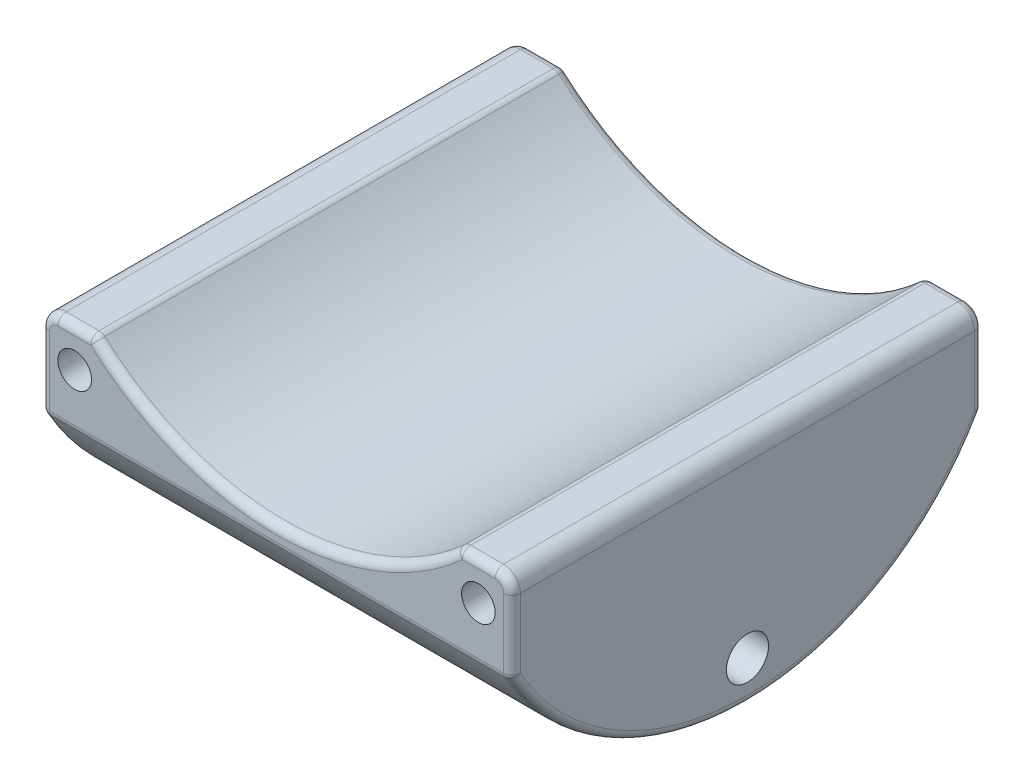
ISO-10303-21;
HEADER;
FILE_DESCRIPTION(('STEP AP214'),'2;1');
FILE_NAME('part.step','',(''),(''),'','','');
FILE_SCHEMA(('AUTOMOTIVE_DESIGN { 1 0 10303 214 1 1 1 1 }'));
ENDSEC;
DATA;
#1=APPLICATION_CONTEXT('core data for automotive mechanical design processes');
#2=APPLICATION_PROTOCOL_DEFINITION('international standard','automotive_design',2000,#1);
#3=PRODUCT_CONTEXT('',#1,'mechanical');
#4=PRODUCT('Part','Part','',(#3));
#5=PRODUCT_RELATED_PRODUCT_CATEGORY('part','',(#4));
#6=PRODUCT_DEFINITION_FORMATION('','',#4);
#7=PRODUCT_DEFINITION_CONTEXT('part definition',#1,'design');
#8=PRODUCT_DEFINITION('design','',#6,#7);
#9=PRODUCT_DEFINITION_SHAPE('','',#8);
#10=(LENGTH_UNIT() NAMED_UNIT(*) SI_UNIT(.MILLI.,.METRE.));
#11=(NAMED_UNIT(*) PLANE_ANGLE_UNIT() SI_UNIT($,.RADIAN.));
#12=(NAMED_UNIT(*) SI_UNIT($,.STERADIAN.) SOLID_ANGLE_UNIT());
#13=UNCERTAINTY_MEASURE_WITH_UNIT(LENGTH_MEASURE(1.E-05),#10,'distance_accuracy_value','');
#14=(GEOMETRIC_REPRESENTATION_CONTEXT(3) GLOBAL_UNCERTAINTY_ASSIGNED_CONTEXT((#13)) GLOBAL_UNIT_ASSIGNED_CONTEXT((#10,
#11,#12)) REPRESENTATION_CONTEXT('',''));
#15=CARTESIAN_POINT('',(0.,0.,0.));
#16=DIRECTION('',(0.,0.,1.));
#17=DIRECTION('',(1.,0.,0.));
#18=AXIS2_PLACEMENT_3D('',#15,#16,#17);
#19=CARTESIAN_POINT('',(-44.45,7.9502,0.));
#20=DIRECTION('',(1.,0.,0.));
#21=DIRECTION('',(0.,0.,-1.));
#22=AXIS2_PLACEMENT_3D('',#19,#20,#21);
#23=PLANE('',#22);
#24=CARTESIAN_POINT('',(-44.45,7.9502,0.));
#25=DIRECTION('',(1.,0.,0.));
#26=DIRECTION('',(0.,0.,-1.));
#27=AXIS2_PLACEMENT_3D('',#24,#25,#26);
#28=CIRCLE('',#27,49.2125);
#29=CARTESIAN_POINT('',(-44.45,-16.2298796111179,-42.8625));
#30=VERTEX_POINT('',#29);
#31=CARTESIAN_POINT('',(-44.45,-16.2298796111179,42.8625));
#32=VERTEX_POINT('',#31);
#33=EDGE_CURVE('E236',#30,#32,#28,.F.);
#34=ORIENTED_EDGE('',*,*,#33,.T.);
#35=DIRECTION('',(0.,-1.,0.));
#36=VECTOR('',#35,1.);
#37=CARTESIAN_POINT('',(-44.45,7.95020000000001,42.8625));
#38=LINE('',#37,#36);
#39=CARTESIAN_POINT('',(-44.45,-3.175,42.8625));
#40=VERTEX_POINT('',#39);
#41=EDGE_CURVE('E238',#32,#40,#38,.F.);
#42=ORIENTED_EDGE('',*,*,#41,.T.);
#43=DIRECTION('',(0.,0.,-1.));
#44=VECTOR('',#43,1.);
#45=CARTESIAN_POINT('',(-44.45,-3.175,-44.45));
#46=LINE('',#45,#44);
#47=CARTESIAN_POINT('',(-44.45,-3.175,-42.8625));
#48=VERTEX_POINT('',#47);
#49=EDGE_CURVE('E423',#40,#48,#46,.T.);
#50=ORIENTED_EDGE('',*,*,#49,.T.);
#51=DIRECTION('',(0.,-1.,0.));
#52=VECTOR('',#51,1.);
#53=CARTESIAN_POINT('',(-44.45,-16.2298796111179,-42.8625));
#54=LINE('',#53,#52);
#55=EDGE_CURVE('E234',#48,#30,#54,.T.);
#56=ORIENTED_EDGE('',*,*,#55,.T.);
#57=EDGE_LOOP('',(#34,#42,#50,#56));
#58=FACE_BOUND('',#57,.T.);
#59=CARTESIAN_POINT('',(-44.45,-35.179,0.));
#60=DIRECTION('',(1.,0.,0.));
#61=DIRECTION('',(0.,0.,-1.));
#62=AXIS2_PLACEMENT_3D('',#59,#60,#61);
#63=CIRCLE('',#62,3.9751);
#64=CARTESIAN_POINT('',(-44.45,-35.179,-3.9751));
#65=VERTEX_POINT('',#64);
#66=EDGE_CURVE('E201',#65,#65,#63,.T.);
#67=ORIENTED_EDGE('',*,*,#66,.T.);
#68=EDGE_LOOP('',(#67));
#69=FACE_BOUND('',#68,.T.);
#70=ADVANCED_FACE('F32',(#58,#69),#23,.F.);
#71=CARTESIAN_POINT('',(44.45,0.,-44.45));
#72=DIRECTION('',(0.,0.,-1.));
#73=DIRECTION('',(0.,1.,0.));
#74=AXIS2_PLACEMENT_3D('',#71,#72,#73);
#75=PLANE('',#74);
#76=DIRECTION('',(1.,0.,0.));
#77=VECTOR('',#76,1.);
#78=CARTESIAN_POINT('',(-44.45,-16.2298796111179,-44.45));
#79=LINE('',#78,#77);
#80=CARTESIAN_POINT('',(42.8625,-16.2298796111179,-44.45));
#81=VERTEX_POINT('',#80);
#82=CARTESIAN_POINT('',(-42.8625,-16.2298796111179,-44.45));
#83=VERTEX_POINT('',#82);
#84=EDGE_CURVE('E269',#81,#83,#79,.F.);
#85=ORIENTED_EDGE('',*,*,#84,.T.);
#86=DIRECTION('',(0.,-1.,0.));
#87=VECTOR('',#86,1.);
#88=CARTESIAN_POINT('',(-42.8625,-3.175,-44.45));
#89=LINE('',#88,#87);
#90=CARTESIAN_POINT('',(-42.8625,-3.175,-44.45));
#91=VERTEX_POINT('',#90);
#92=EDGE_CURVE('E11',#83,#91,#89,.F.);
#93=ORIENTED_EDGE('',*,*,#92,.T.);
#94=CARTESIAN_POINT('',(-41.275,-3.175,-44.45));
#95=DIRECTION('',(0.,0.,-1.));
#96=DIRECTION('',(0.,1.,0.));
#97=AXIS2_PLACEMENT_3D('',#94,#95,#96);
#98=CIRCLE('',#97,1.5875);
#99=CARTESIAN_POINT('',(-41.275,-1.5875,-44.45));
#100=VERTEX_POINT('',#99);
#101=EDGE_CURVE('E264',#91,#100,#98,.T.);
#102=ORIENTED_EDGE('',*,*,#101,.T.);
#103=DIRECTION('',(-1.,0.,0.));
#104=VECTOR('',#103,1.);
#105=CARTESIAN_POINT('',(44.45,-1.5875,-44.45));
#106=LINE('',#105,#104);
#107=CARTESIAN_POINT('',(-35.0676729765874,-1.5875,-44.45));
#108=VERTEX_POINT('',#107);
#109=EDGE_CURVE('E261',#100,#108,#106,.F.);
#110=ORIENTED_EDGE('',*,*,#109,.T.);
#111=CARTESIAN_POINT('',(0.,37.3317557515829,-44.45));
#112=DIRECTION('',(0.,0.,-1.));
#113=DIRECTION('',(0.,1.,0.));
#114=AXIS2_PLACEMENT_3D('',#111,#112,#113);
#115=CIRCLE('',#114,52.3875);
#116=CARTESIAN_POINT('',(35.0676729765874,-1.5875,-44.45));
#117=VERTEX_POINT('',#116);
#118=EDGE_CURVE('E197',#108,#117,#115,.F.);
#119=ORIENTED_EDGE('',*,*,#118,.T.);
#120=DIRECTION('',(-1.,0.,0.));
#121=VECTOR('',#120,1.);
#122=CARTESIAN_POINT('',(44.45,-1.5875,-44.45));
#123=LINE('',#122,#121);
#124=CARTESIAN_POINT('',(41.275,-1.5875,-44.45));
#125=VERTEX_POINT('',#124);
#126=EDGE_CURVE('E259',#117,#125,#123,.F.);
#127=ORIENTED_EDGE('',*,*,#126,.T.);
#128=CARTESIAN_POINT('',(41.275,-3.175,-44.45));
#129=DIRECTION('',(0.,0.,-1.));
#130=DIRECTION('',(0.,1.,0.));
#131=AXIS2_PLACEMENT_3D('',#128,#129,#130);
#132=CIRCLE('',#131,1.5875);
#133=CARTESIAN_POINT('',(42.8625,-3.175,-44.45));
#134=VERTEX_POINT('',#133);
#135=EDGE_CURVE('E52',#125,#134,#132,.T.);
#136=ORIENTED_EDGE('',*,*,#135,.T.);
#137=DIRECTION('',(0.,-1.,0.));
#138=VECTOR('',#137,1.);
#139=CARTESIAN_POINT('',(42.8625,0.,-44.45));
#140=LINE('',#139,#138);
#141=EDGE_CURVE('E40',#134,#81,#140,.T.);
#142=ORIENTED_EDGE('',*,*,#141,.T.);
#143=EDGE_LOOP('',(#85,#93,#102,#110,#119,#127,#136,#142));
#144=FACE_BOUND('',#143,.T.);
#145=CARTESIAN_POINT('',(-38.1,-7.13740000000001,-44.45));
#146=DIRECTION('',(0.,0.,1.));
#147=DIRECTION('',(1.,0.,0.));
#148=AXIS2_PLACEMENT_3D('',#145,#146,#147);
#149=CIRCLE('',#148,3.17500000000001);
#150=CARTESIAN_POINT('',(-34.925,-7.13740000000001,-44.45));
#151=VERTEX_POINT('',#150);
#152=EDGE_CURVE('E399',#151,#151,#149,.T.);
#153=ORIENTED_EDGE('',*,*,#152,.T.);
#154=EDGE_LOOP('',(#153));
#155=FACE_BOUND('',#154,.T.);
#156=CARTESIAN_POINT('',(38.1,-7.13740000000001,-44.45));
#157=DIRECTION('',(0.,0.,1.));
#158=DIRECTION('',(1.,0.,0.));
#159=AXIS2_PLACEMENT_3D('',#156,#157,#158);
#160=CIRCLE('',#159,3.17500000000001);
#161=CARTESIAN_POINT('',(41.275,-7.13740000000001,-44.45));
#162=VERTEX_POINT('',#161);
#163=EDGE_CURVE('E393',#162,#162,#160,.T.);
#164=ORIENTED_EDGE('',*,*,#163,.T.);
#165=EDGE_LOOP('',(#164));
#166=FACE_BOUND('',#165,.T.);
#167=ADVANCED_FACE('F267',(#144,#155,#166),#75,.T.);
#168=CARTESIAN_POINT('',(44.45,0.,44.45));
#169=DIRECTION('',(0.,0.,-1.));
#170=DIRECTION('',(0.,1.,0.));
#171=AXIS2_PLACEMENT_3D('',#168,#169,#170);
#172=PLANE('',#171);
#173=CARTESIAN_POINT('',(38.1,-7.13740000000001,44.45));
#174=DIRECTION('',(0.,0.,1.));
#175=DIRECTION('',(1.,0.,0.));
#176=AXIS2_PLACEMENT_3D('',#173,#174,#175);
#177=CIRCLE('',#176,3.17500000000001);
#178=CARTESIAN_POINT('',(41.275,-7.13740000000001,44.45));
#179=VERTEX_POINT('',#178);
#180=EDGE_CURVE('E405',#179,#179,#177,.T.);
#181=ORIENTED_EDGE('',*,*,#180,.F.);
#182=EDGE_LOOP('',(#181));
#183=FACE_BOUND('',#182,.T.);
#184=CARTESIAN_POINT('',(-38.1,-7.13740000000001,44.45));
#185=DIRECTION('',(0.,0.,1.));
#186=DIRECTION('',(1.,0.,0.));
#187=AXIS2_PLACEMENT_3D('',#184,#185,#186);
#188=CIRCLE('',#187,3.17500000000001);
#189=CARTESIAN_POINT('',(-34.925,-7.13740000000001,44.45));
#190=VERTEX_POINT('',#189);
#191=EDGE_CURVE('E411',#190,#190,#188,.T.);
#192=ORIENTED_EDGE('',*,*,#191,.F.);
#193=EDGE_LOOP('',(#192));
#194=FACE_BOUND('',#193,.T.);
#195=CARTESIAN_POINT('',(-41.275,-3.175,44.45));
#196=DIRECTION('',(0.,0.,-1.));
#197=DIRECTION('',(0.,1.,0.));
#198=AXIS2_PLACEMENT_3D('',#195,#196,#197);
#199=CIRCLE('',#198,1.5875);
#200=CARTESIAN_POINT('',(-41.275,-1.5875,44.45));
#201=VERTEX_POINT('',#200);
#202=CARTESIAN_POINT('',(-42.8625,-3.175,44.45));
#203=VERTEX_POINT('',#202);
#204=EDGE_CURVE('E211',#201,#203,#199,.F.);
#205=ORIENTED_EDGE('',*,*,#204,.T.);
#206=DIRECTION('',(0.,-1.,0.));
#207=VECTOR('',#206,1.);
#208=CARTESIAN_POINT('',(-42.8625,0.,44.45));
#209=LINE('',#208,#207);
#210=CARTESIAN_POINT('',(-42.8625,-16.2298796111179,44.45));
#211=VERTEX_POINT('',#210);
#212=EDGE_CURVE('E207',#203,#211,#209,.T.);
#213=ORIENTED_EDGE('',*,*,#212,.T.);
#214=DIRECTION('',(-1.,0.,0.));
#215=VECTOR('',#214,1.);
#216=CARTESIAN_POINT('',(44.45,-16.2298796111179,44.45));
#217=LINE('',#216,#215);
#218=CARTESIAN_POINT('',(42.8625,-16.2298796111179,44.45));
#219=VERTEX_POINT('',#218);
#220=EDGE_CURVE('E191',#211,#219,#217,.F.);
#221=ORIENTED_EDGE('',*,*,#220,.T.);
#222=DIRECTION('',(0.,-1.,0.));
#223=VECTOR('',#222,1.);
#224=CARTESIAN_POINT('',(42.8625,-3.175,44.45));
#225=LINE('',#224,#223);
#226=CARTESIAN_POINT('',(42.8625,-3.175,44.45));
#227=VERTEX_POINT('',#226);
#228=EDGE_CURVE('E320',#219,#227,#225,.F.);
#229=ORIENTED_EDGE('',*,*,#228,.T.);
#230=CARTESIAN_POINT('',(41.275,-3.175,44.45));
#231=DIRECTION('',(0.,0.,-1.));
#232=DIRECTION('',(0.,1.,0.));
#233=AXIS2_PLACEMENT_3D('',#230,#231,#232);
#234=CIRCLE('',#233,1.5875);
#235=CARTESIAN_POINT('',(41.275,-1.5875,44.45));
#236=VERTEX_POINT('',#235);
#237=EDGE_CURVE('E322',#227,#236,#234,.F.);
#238=ORIENTED_EDGE('',*,*,#237,.T.);
#239=DIRECTION('',(-1.,0.,0.));
#240=VECTOR('',#239,1.);
#241=CARTESIAN_POINT('',(35.0676729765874,-1.5875,44.45));
#242=LINE('',#241,#240);
#243=CARTESIAN_POINT('',(35.0676729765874,-1.5875,44.45));
#244=VERTEX_POINT('',#243);
#245=EDGE_CURVE('E324',#236,#244,#242,.T.);
#246=ORIENTED_EDGE('',*,*,#245,.T.);
#247=CARTESIAN_POINT('',(0.,37.3317557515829,44.45));
#248=DIRECTION('',(0.,0.,-1.));
#249=DIRECTION('',(0.,1.,0.));
#250=AXIS2_PLACEMENT_3D('',#247,#248,#249);
#251=CIRCLE('',#250,52.3875);
#252=CARTESIAN_POINT('',(-35.0676729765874,-1.5875,44.45));
#253=VERTEX_POINT('',#252);
#254=EDGE_CURVE('E326',#244,#253,#251,.T.);
#255=ORIENTED_EDGE('',*,*,#254,.T.);
#256=DIRECTION('',(-1.,0.,0.));
#257=VECTOR('',#256,1.);
#258=CARTESIAN_POINT('',(-41.275,-1.5875,44.45));
#259=LINE('',#258,#257);
#260=EDGE_CURVE('E329',#253,#201,#259,.T.);
#261=ORIENTED_EDGE('',*,*,#260,.T.);
#262=EDGE_LOOP('',(#205,#213,#221,#229,#238,#246,#255,#261));
#263=FACE_BOUND('',#262,.T.);
#264=ADVANCED_FACE('F34',(#183,#194,#263),#172,.F.);
#265=CARTESIAN_POINT('',(44.45,0.,44.45));
#266=DIRECTION('',(0.,1.,0.));
#267=DIRECTION('',(0.,0.,1.));
#268=AXIS2_PLACEMENT_3D('',#265,#266,#267);
#269=PLANE('',#268);
#270=DIRECTION('',(0.,0.,-1.));
#271=VECTOR('',#270,1.);
#272=CARTESIAN_POINT('',(35.0676729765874,0.,44.45));
#273=LINE('',#272,#271);
#274=CARTESIAN_POINT('',(35.0676729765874,0.,-42.8625));
#275=VERTEX_POINT('',#274);
#276=CARTESIAN_POINT('',(35.0676729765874,0.,42.8625));
#277=VERTEX_POINT('',#276);
#278=EDGE_CURVE('E315',#275,#277,#273,.F.);
#279=ORIENTED_EDGE('',*,*,#278,.T.);
#280=DIRECTION('',(-1.,0.,0.));
#281=VECTOR('',#280,1.);
#282=CARTESIAN_POINT('',(41.275,0.,42.8625));
#283=LINE('',#282,#281);
#284=CARTESIAN_POINT('',(41.275,0.,42.8625));
#285=VERTEX_POINT('',#284);
#286=EDGE_CURVE('E224',#277,#285,#283,.F.);
#287=ORIENTED_EDGE('',*,*,#286,.T.);
#288=DIRECTION('',(0.,0.,-1.));
#289=VECTOR('',#288,1.);
#290=CARTESIAN_POINT('',(41.275,0.,44.45));
#291=LINE('',#290,#289);
#292=CARTESIAN_POINT('',(41.275,0.,-42.8625));
#293=VERTEX_POINT('',#292);
#294=EDGE_CURVE('E417',#285,#293,#291,.T.);
#295=ORIENTED_EDGE('',*,*,#294,.T.);
#296=DIRECTION('',(-1.,0.,0.));
#297=VECTOR('',#296,1.);
#298=CARTESIAN_POINT('',(44.45,0.,-42.8625));
#299=LINE('',#298,#297);
#300=EDGE_CURVE('E222',#293,#275,#299,.T.);
#301=ORIENTED_EDGE('',*,*,#300,.T.);
#302=EDGE_LOOP('',(#279,#287,#295,#301));
#303=FACE_BOUND('',#302,.T.);
#304=ADVANCED_FACE('F435',(#303),#269,.T.);
#305=DIRECTION('',(0.,0.,-1.));
#306=VECTOR('',#305,1.);
#307=CARTESIAN_POINT('',(-41.275,0.,44.45));
#308=LINE('',#307,#306);
#309=CARTESIAN_POINT('',(-41.275,0.,-42.8625));
#310=VERTEX_POINT('',#309);
#311=CARTESIAN_POINT('',(-41.275,0.,42.8625));
#312=VERTEX_POINT('',#311);
#313=EDGE_CURVE('E426',#310,#312,#308,.F.);
#314=ORIENTED_EDGE('',*,*,#313,.T.);
#315=DIRECTION('',(-1.,0.,0.));
#316=VECTOR('',#315,1.);
#317=CARTESIAN_POINT('',(-35.0676729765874,0.,42.8625));
#318=LINE('',#317,#316);
#319=CARTESIAN_POINT('',(-35.0676729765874,0.,42.8625));
#320=VERTEX_POINT('',#319);
#321=EDGE_CURVE('E220',#312,#320,#318,.F.);
#322=ORIENTED_EDGE('',*,*,#321,.T.);
#323=DIRECTION('',(0.,0.,-1.));
#324=VECTOR('',#323,1.);
#325=CARTESIAN_POINT('',(-35.0676729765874,0.,44.45));
#326=LINE('',#325,#324);
#327=CARTESIAN_POINT('',(-35.0676729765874,0.,-42.8625));
#328=VERTEX_POINT('',#327);
#329=EDGE_CURVE('E279',#320,#328,#326,.T.);
#330=ORIENTED_EDGE('',*,*,#329,.T.);
#331=DIRECTION('',(-1.,0.,0.));
#332=VECTOR('',#331,1.);
#333=CARTESIAN_POINT('',(44.45,0.,-42.8625));
#334=LINE('',#333,#332);
#335=EDGE_CURVE('E218',#328,#310,#334,.T.);
#336=ORIENTED_EDGE('',*,*,#335,.T.);
#337=EDGE_LOOP('',(#314,#322,#330,#336));
#338=FACE_BOUND('',#337,.T.);
#339=ADVANCED_FACE('F468',(#338),#269,.T.);
#340=CARTESIAN_POINT('',(44.45,7.9502,0.));
#341=DIRECTION('',(-1.,0.,0.));
#342=DIRECTION('',(0.,0.,1.));
#343=AXIS2_PLACEMENT_3D('',#340,#341,#342);
#344=CYLINDRICAL_SURFACE('',#343,50.8);
#345=DIRECTION('',(-1.,0.,0.));
#346=VECTOR('',#345,1.);
#347=CARTESIAN_POINT('',(44.45,-17.0098821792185,44.2451612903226));
#348=LINE('',#347,#346);
#349=CARTESIAN_POINT('',(42.8625,-17.0098821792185,44.2451612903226));
#350=VERTEX_POINT('',#349);
#351=CARTESIAN_POINT('',(-42.8625,-17.0098821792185,44.2451612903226));
#352=VERTEX_POINT('',#351);
#353=EDGE_CURVE('E181',#350,#352,#348,.T.);
#354=ORIENTED_EDGE('',*,*,#353,.T.);
#355=CARTESIAN_POINT('',(-42.8625,7.9502,0.));
#356=DIRECTION('',(1.,0.,0.));
#357=DIRECTION('',(0.,0.,-1.));
#358=AXIS2_PLACEMENT_3D('',#355,#356,#357);
#359=CIRCLE('',#358,50.8);
#360=CARTESIAN_POINT('',(-42.8625,-17.0098821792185,-44.2451612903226));
#361=VERTEX_POINT('',#360);
#362=EDGE_CURVE('E252',#352,#361,#359,.T.);
#363=ORIENTED_EDGE('',*,*,#362,.T.);
#364=DIRECTION('',(-1.,0.,0.));
#365=VECTOR('',#364,1.);
#366=CARTESIAN_POINT('',(44.45,-17.0098821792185,-44.2451612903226));
#367=LINE('',#366,#365);
#368=CARTESIAN_POINT('',(42.8625,-17.0098821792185,-44.2451612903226));
#369=VERTEX_POINT('',#368);
#370=EDGE_CURVE('E308',#361,#369,#367,.F.);
#371=ORIENTED_EDGE('',*,*,#370,.T.);
#372=CARTESIAN_POINT('',(42.8625,7.9502,0.));
#373=DIRECTION('',(1.,0.,0.));
#374=DIRECTION('',(0.,0.,-1.));
#375=AXIS2_PLACEMENT_3D('',#372,#373,#374);
#376=CIRCLE('',#375,50.8);
#377=EDGE_CURVE('E250',#369,#350,#376,.F.);
#378=ORIENTED_EDGE('',*,*,#377,.T.);
#379=EDGE_LOOP('',(#354,#363,#371,#378));
#380=FACE_BOUND('',#379,.T.);
#381=ADVANCED_FACE('F306',(#380),#344,.T.);
#382=CARTESIAN_POINT('',(44.45,7.9502,0.));
#383=DIRECTION('',(1.,0.,0.));
#384=DIRECTION('',(0.,0.,-1.));
#385=AXIS2_PLACEMENT_3D('',#382,#383,#384);
#386=PLANE('',#385);
#387=CARTESIAN_POINT('',(44.45,-35.179,0.));
#388=DIRECTION('',(1.,0.,0.));
#389=DIRECTION('',(0.,0.,-1.));
#390=AXIS2_PLACEMENT_3D('',#387,#388,#389);
#391=CIRCLE('',#390,3.9751);
#392=CARTESIAN_POINT('',(44.45,-35.179,-3.9751));
#393=VERTEX_POINT('',#392);
#394=EDGE_CURVE('E387',#393,#393,#391,.T.);
#395=ORIENTED_EDGE('',*,*,#394,.F.);
#396=EDGE_LOOP('',(#395));
#397=FACE_BOUND('',#396,.T.);
#398=DIRECTION('',(0.,0.,-1.));
#399=VECTOR('',#398,1.);
#400=CARTESIAN_POINT('',(44.45,-3.175,0.));
#401=LINE('',#400,#399);
#402=CARTESIAN_POINT('',(44.45,-3.175,-42.8625));
#403=VERTEX_POINT('',#402);
#404=CARTESIAN_POINT('',(44.45,-3.175,42.8625));
#405=VERTEX_POINT('',#404);
#406=EDGE_CURVE('E420',#403,#405,#401,.F.);
#407=ORIENTED_EDGE('',*,*,#406,.T.);
#408=DIRECTION('',(0.,-1.,0.));
#409=VECTOR('',#408,1.);
#410=CARTESIAN_POINT('',(44.45,-16.2298796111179,42.8625));
#411=LINE('',#410,#409);
#412=CARTESIAN_POINT('',(44.45,-16.2298796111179,42.8625));
#413=VERTEX_POINT('',#412);
#414=EDGE_CURVE('E244',#405,#413,#411,.T.);
#415=ORIENTED_EDGE('',*,*,#414,.T.);
#416=CARTESIAN_POINT('',(44.45,7.9502,0.));
#417=DIRECTION('',(1.,0.,0.));
#418=DIRECTION('',(0.,0.,-1.));
#419=AXIS2_PLACEMENT_3D('',#416,#417,#418);
#420=CIRCLE('',#419,49.2125);
#421=CARTESIAN_POINT('',(44.45,-16.2298796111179,-42.8625));
#422=VERTEX_POINT('',#421);
#423=EDGE_CURVE('E242',#413,#422,#420,.T.);
#424=ORIENTED_EDGE('',*,*,#423,.T.);
#425=DIRECTION('',(0.,-1.,0.));
#426=VECTOR('',#425,1.);
#427=CARTESIAN_POINT('',(44.45,7.95019999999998,-42.8625));
#428=LINE('',#427,#426);
#429=EDGE_CURVE('E240',#422,#403,#428,.F.);
#430=ORIENTED_EDGE('',*,*,#429,.T.);
#431=EDGE_LOOP('',(#407,#415,#424,#430));
#432=FACE_BOUND('',#431,.T.);
#433=ADVANCED_FACE('F513',(#397,#432),#386,.T.);
#434=CARTESIAN_POINT('',(0.,37.3317557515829,44.45));
#435=DIRECTION('',(0.,0.,-1.));
#436=DIRECTION('',(-1.,0.,0.));
#437=AXIS2_PLACEMENT_3D('',#434,#435,#436);
#438=CYLINDRICAL_SURFACE('',#437,50.8);
#439=DIRECTION('',(0.,0.,-1.));
#440=VECTOR('',#439,1.);
#441=CARTESIAN_POINT('',(-34.0050162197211,-0.408128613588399,44.45));
#442=LINE('',#441,#440);
#443=CARTESIAN_POINT('',(-34.0050162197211,-0.408128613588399,-42.8625));
#444=VERTEX_POINT('',#443);
#445=CARTESIAN_POINT('',(-34.0050162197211,-0.408128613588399,42.8625));
#446=VERTEX_POINT('',#445);
#447=EDGE_CURVE('E172',#444,#446,#442,.F.);
#448=ORIENTED_EDGE('',*,*,#447,.T.);
#449=CARTESIAN_POINT('',(0.,37.3317557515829,42.8625));
#450=DIRECTION('',(0.,0.,-1.));
#451=DIRECTION('',(0.,1.,0.));
#452=AXIS2_PLACEMENT_3D('',#449,#450,#451);
#453=CIRCLE('',#452,50.8);
#454=CARTESIAN_POINT('',(34.0050162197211,-0.408128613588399,42.8625));
#455=VERTEX_POINT('',#454);
#456=EDGE_CURVE('E180',#446,#455,#453,.F.);
#457=ORIENTED_EDGE('',*,*,#456,.T.);
#458=DIRECTION('',(0.,0.,-1.));
#459=VECTOR('',#458,1.);
#460=CARTESIAN_POINT('',(34.0050162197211,-0.408128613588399,44.45));
#461=LINE('',#460,#459);
#462=CARTESIAN_POINT('',(34.0050162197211,-0.408128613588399,-42.8625));
#463=VERTEX_POINT('',#462);
#464=EDGE_CURVE('E175',#455,#463,#461,.T.);
#465=ORIENTED_EDGE('',*,*,#464,.T.);
#466=CARTESIAN_POINT('',(0.,37.3317557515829,-42.8625));
#467=DIRECTION('',(0.,0.,-1.));
#468=DIRECTION('',(0.,1.,0.));
#469=AXIS2_PLACEMENT_3D('',#466,#467,#468);
#470=CIRCLE('',#469,50.8);
#471=EDGE_CURVE('E168',#463,#444,#470,.T.);
#472=ORIENTED_EDGE('',*,*,#471,.T.);
#473=EDGE_LOOP('',(#448,#457,#465,#472));
#474=FACE_BOUND('',#473,.T.);
#475=ADVANCED_FACE('F170',(#474),#438,.F.);
#476=CARTESIAN_POINT('',(41.275,-3.175,44.45));
#477=DIRECTION('',(0.,0.,-1.));
#478=DIRECTION('',(-1.,0.,0.));
#479=AXIS2_PLACEMENT_3D('',#476,#477,#478);
#480=CYLINDRICAL_SURFACE('',#479,3.175);
#481=ORIENTED_EDGE('',*,*,#294,.F.);
#482=CARTESIAN_POINT('',(41.275,-3.175,42.8625));
#483=DIRECTION('',(0.,0.,-1.));
#484=DIRECTION('',(0.,1.,0.));
#485=AXIS2_PLACEMENT_3D('',#482,#483,#484);
#486=CIRCLE('',#485,3.175);
#487=EDGE_CURVE('E232',#285,#405,#486,.T.);
#488=ORIENTED_EDGE('',*,*,#487,.T.);
#489=ORIENTED_EDGE('',*,*,#406,.F.);
#490=CARTESIAN_POINT('',(41.275,-3.175,-42.8625));
#491=DIRECTION('',(0.,0.,-1.));
#492=DIRECTION('',(0.,1.,0.));
#493=AXIS2_PLACEMENT_3D('',#490,#491,#492);
#494=CIRCLE('',#493,3.175);
#495=EDGE_CURVE('E230',#403,#293,#494,.F.);
#496=ORIENTED_EDGE('',*,*,#495,.T.);
#497=EDGE_LOOP('',(#481,#488,#489,#496));
#498=FACE_BOUND('',#497,.T.);
#499=ADVANCED_FACE('F673',(#498),#480,.T.);
#500=CARTESIAN_POINT('',(-41.275,-3.175,0.));
#501=DIRECTION('',(0.,0.,1.));
#502=DIRECTION('',(1.,0.,0.));
#503=AXIS2_PLACEMENT_3D('',#500,#501,#502);
#504=CYLINDRICAL_SURFACE('',#503,3.175);
#505=ORIENTED_EDGE('',*,*,#49,.F.);
#506=CARTESIAN_POINT('',(-41.275,-3.175,42.8625));
#507=DIRECTION('',(0.,0.,-1.));
#508=DIRECTION('',(0.,1.,0.));
#509=AXIS2_PLACEMENT_3D('',#506,#507,#508);
#510=CIRCLE('',#509,3.175);
#511=EDGE_CURVE('E228',#40,#312,#510,.T.);
#512=ORIENTED_EDGE('',*,*,#511,.T.);
#513=ORIENTED_EDGE('',*,*,#313,.F.);
#514=CARTESIAN_POINT('',(-41.275,-3.175,-42.8625));
#515=DIRECTION('',(0.,0.,-1.));
#516=DIRECTION('',(0.,1.,0.));
#517=AXIS2_PLACEMENT_3D('',#514,#515,#516);
#518=CIRCLE('',#517,3.175);
#519=EDGE_CURVE('E226',#310,#48,#518,.F.);
#520=ORIENTED_EDGE('',*,*,#519,.T.);
#521=EDGE_LOOP('',(#505,#512,#513,#520));
#522=FACE_BOUND('',#521,.T.);
#523=ADVANCED_FACE('F473',(#522),#504,.T.);
#524=CARTESIAN_POINT('',(-38.1,-7.13740000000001,23.8125));
#525=DIRECTION('',(0.,0.,1.));
#526=DIRECTION('',(1.,0.,0.));
#527=AXIS2_PLACEMENT_3D('',#524,#525,#526);
#528=CYLINDRICAL_SURFACE('',#527,3.17500000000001);
#529=CARTESIAN_POINT('',(-38.1,-7.13740000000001,23.8125));
#530=DIRECTION('',(0.,0.,1.));
#531=DIRECTION('',(1.,0.,0.));
#532=AXIS2_PLACEMENT_3D('',#529,#530,#531);
#533=CIRCLE('',#532,3.17500000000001);
#534=CARTESIAN_POINT('',(-34.925,-7.13740000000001,23.8125));
#535=VERTEX_POINT('',#534);
#536=EDGE_CURVE('E414',#535,#535,#533,.T.);
#537=ORIENTED_EDGE('',*,*,#536,.F.);
#538=EDGE_LOOP('',(#537));
#539=FACE_BOUND('',#538,.T.);
#540=ORIENTED_EDGE('',*,*,#191,.T.);
#541=EDGE_LOOP('',(#540));
#542=FACE_BOUND('',#541,.T.);
#543=ADVANCED_FACE('F654',(#539,#542),#528,.F.);
#544=CARTESIAN_POINT('',(-38.1,-7.13740000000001,23.8125));
#545=DIRECTION('',(0.,0.,1.));
#546=DIRECTION('',(1.,0.,0.));
#547=AXIS2_PLACEMENT_3D('',#544,#545,#546);
#548=PLANE('',#547);
#549=ORIENTED_EDGE('',*,*,#536,.T.);
#550=EDGE_LOOP('',(#549));
#551=FACE_BOUND('',#550,.T.);
#552=ADVANCED_FACE('F637',(#551),#548,.T.);
#553=CARTESIAN_POINT('',(38.1,-7.13740000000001,23.8125));
#554=DIRECTION('',(0.,0.,1.));
#555=DIRECTION('',(1.,0.,0.));
#556=AXIS2_PLACEMENT_3D('',#553,#554,#555);
#557=CYLINDRICAL_SURFACE('',#556,3.17500000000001);
#558=CARTESIAN_POINT('',(38.1,-7.13740000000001,23.8125));
#559=DIRECTION('',(0.,0.,1.));
#560=DIRECTION('',(1.,0.,0.));
#561=AXIS2_PLACEMENT_3D('',#558,#559,#560);
#562=CIRCLE('',#561,3.17500000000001);
#563=CARTESIAN_POINT('',(41.275,-7.13740000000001,23.8125));
#564=VERTEX_POINT('',#563);
#565=EDGE_CURVE('E408',#564,#564,#562,.T.);
#566=ORIENTED_EDGE('',*,*,#565,.F.);
#567=EDGE_LOOP('',(#566));
#568=FACE_BOUND('',#567,.T.);
#569=ORIENTED_EDGE('',*,*,#180,.T.);
#570=EDGE_LOOP('',(#569));
#571=FACE_BOUND('',#570,.T.);
#572=ADVANCED_FACE('F628',(#568,#571),#557,.F.);
#573=CARTESIAN_POINT('',(38.1,-7.13740000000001,23.8125));
#574=DIRECTION('',(0.,0.,1.));
#575=DIRECTION('',(1.,0.,0.));
#576=AXIS2_PLACEMENT_3D('',#573,#574,#575);
#577=PLANE('',#576);
#578=ORIENTED_EDGE('',*,*,#565,.T.);
#579=EDGE_LOOP('',(#578));
#580=FACE_BOUND('',#579,.T.);
#581=ADVANCED_FACE('F625',(#580),#577,.T.);
#582=CARTESIAN_POINT('',(-38.1,-7.13740000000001,-23.8125));
#583=DIRECTION('',(0.,0.,-1.));
#584=DIRECTION('',(-1.,0.,0.));
#585=AXIS2_PLACEMENT_3D('',#582,#583,#584);
#586=CYLINDRICAL_SURFACE('',#585,3.17500000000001);
#587=CARTESIAN_POINT('',(-38.1,-7.13740000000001,-23.8125));
#588=DIRECTION('',(0.,0.,1.));
#589=DIRECTION('',(1.,0.,0.));
#590=AXIS2_PLACEMENT_3D('',#587,#588,#589);
#591=CIRCLE('',#590,3.17500000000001);
#592=CARTESIAN_POINT('',(-34.925,-7.13740000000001,-23.8125));
#593=VERTEX_POINT('',#592);
#594=EDGE_CURVE('E402',#593,#593,#591,.T.);
#595=ORIENTED_EDGE('',*,*,#594,.T.);
#596=EDGE_LOOP('',(#595));
#597=FACE_BOUND('',#596,.T.);
#598=ORIENTED_EDGE('',*,*,#152,.F.);
#599=EDGE_LOOP('',(#598));
#600=FACE_BOUND('',#599,.T.);
#601=ADVANCED_FACE('F616',(#597,#600),#586,.F.);
#602=CARTESIAN_POINT('',(-38.1,-7.13740000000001,-23.8125));
#603=DIRECTION('',(0.,0.,-1.));
#604=DIRECTION('',(1.,0.,0.));
#605=AXIS2_PLACEMENT_3D('',#602,#603,#604);
#606=PLANE('',#605);
#607=ORIENTED_EDGE('',*,*,#594,.F.);
#608=EDGE_LOOP('',(#607));
#609=FACE_BOUND('',#608,.T.);
#610=ADVANCED_FACE('F606',(#609),#606,.T.);
#611=CARTESIAN_POINT('',(38.1,-7.13740000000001,-23.8125));
#612=DIRECTION('',(0.,0.,-1.));
#613=DIRECTION('',(-1.,0.,0.));
#614=AXIS2_PLACEMENT_3D('',#611,#612,#613);
#615=CYLINDRICAL_SURFACE('',#614,3.17500000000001);
#616=CARTESIAN_POINT('',(38.1,-7.13740000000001,-23.8125));
#617=DIRECTION('',(0.,0.,1.));
#618=DIRECTION('',(1.,0.,0.));
#619=AXIS2_PLACEMENT_3D('',#616,#617,#618);
#620=CIRCLE('',#619,3.17500000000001);
#621=CARTESIAN_POINT('',(41.275,-7.13740000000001,-23.8125));
#622=VERTEX_POINT('',#621);
#623=EDGE_CURVE('E396',#622,#622,#620,.T.);
#624=ORIENTED_EDGE('',*,*,#623,.T.);
#625=EDGE_LOOP('',(#624));
#626=FACE_BOUND('',#625,.T.);
#627=ORIENTED_EDGE('',*,*,#163,.F.);
#628=EDGE_LOOP('',(#627));
#629=FACE_BOUND('',#628,.T.);
#630=ADVANCED_FACE('F596',(#626,#629),#615,.F.);
#631=CARTESIAN_POINT('',(38.1,-7.13740000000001,-23.8125));
#632=DIRECTION('',(0.,0.,-1.));
#633=DIRECTION('',(1.,0.,0.));
#634=AXIS2_PLACEMENT_3D('',#631,#632,#633);
#635=PLANE('',#634);
#636=ORIENTED_EDGE('',*,*,#623,.F.);
#637=EDGE_LOOP('',(#636));
#638=FACE_BOUND('',#637,.T.);
#639=ADVANCED_FACE('F586',(#638),#635,.T.);
#640=CARTESIAN_POINT('',(26.9875,-35.179,0.));
#641=DIRECTION('',(1.,0.,0.));
#642=DIRECTION('',(0.,0.,-1.));
#643=AXIS2_PLACEMENT_3D('',#640,#641,#642);
#644=CYLINDRICAL_SURFACE('',#643,3.9751);
#645=CARTESIAN_POINT('',(26.9875,-35.179,0.));
#646=DIRECTION('',(1.,0.,0.));
#647=DIRECTION('',(0.,0.,-1.));
#648=AXIS2_PLACEMENT_3D('',#645,#646,#647);
#649=CIRCLE('',#648,3.9751);
#650=CARTESIAN_POINT('',(26.9875,-35.179,-3.9751));
#651=VERTEX_POINT('',#650);
#652=EDGE_CURVE('E390',#651,#651,#649,.T.);
#653=ORIENTED_EDGE('',*,*,#652,.F.);
#654=EDGE_LOOP('',(#653));
#655=FACE_BOUND('',#654,.T.);
#656=ORIENTED_EDGE('',*,*,#394,.T.);
#657=EDGE_LOOP('',(#656));
#658=FACE_BOUND('',#657,.T.);
#659=ADVANCED_FACE('F576',(#655,#658),#644,.F.);
#660=CARTESIAN_POINT('',(26.9875,-35.179,0.));
#661=DIRECTION('',(1.,0.,0.));
#662=DIRECTION('',(0.,0.,-1.));
#663=AXIS2_PLACEMENT_3D('',#660,#661,#662);
#664=PLANE('',#663);
#665=ORIENTED_EDGE('',*,*,#652,.T.);
#666=EDGE_LOOP('',(#665));
#667=FACE_BOUND('',#666,.T.);
#668=ADVANCED_FACE('F567',(#667),#664,.T.);
#669=CARTESIAN_POINT('',(-26.9875,-35.179,0.));
#670=DIRECTION('',(-1.,0.,0.));
#671=DIRECTION('',(0.,0.,1.));
#672=AXIS2_PLACEMENT_3D('',#669,#670,#671);
#673=CYLINDRICAL_SURFACE('',#672,3.9751);
#674=CARTESIAN_POINT('',(-26.9875,-35.179,0.));
#675=DIRECTION('',(1.,0.,0.));
#676=DIRECTION('',(0.,0.,-1.));
#677=AXIS2_PLACEMENT_3D('',#674,#675,#676);
#678=CIRCLE('',#677,3.9751);
#679=CARTESIAN_POINT('',(-26.9875,-35.179,-3.9751));
#680=VERTEX_POINT('',#679);
#681=EDGE_CURVE('E384',#680,#680,#678,.T.);
#682=ORIENTED_EDGE('',*,*,#681,.T.);
#683=EDGE_LOOP('',(#682));
#684=FACE_BOUND('',#683,.T.);
#685=ORIENTED_EDGE('',*,*,#66,.F.);
#686=EDGE_LOOP('',(#685));
#687=FACE_BOUND('',#686,.T.);
#688=ADVANCED_FACE('F556',(#684,#687),#673,.F.);
#689=CARTESIAN_POINT('',(-26.9875,-35.179,0.));
#690=DIRECTION('',(-1.,0.,0.));
#691=DIRECTION('',(0.,0.,-1.));
#692=AXIS2_PLACEMENT_3D('',#689,#690,#691);
#693=PLANE('',#692);
#694=ORIENTED_EDGE('',*,*,#681,.F.);
#695=EDGE_LOOP('',(#694));
#696=FACE_BOUND('',#695,.T.);
#697=ADVANCED_FACE('F551',(#696),#693,.T.);
#698=CARTESIAN_POINT('',(-35.0676729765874,-1.5875,44.45));
#699=DIRECTION('',(0.,0.,-1.));
#700=DIRECTION('',(-1.,0.,0.));
#701=AXIS2_PLACEMENT_3D('',#698,#699,#700);
#702=CYLINDRICAL_SURFACE('',#701,1.5875);
#703=ORIENTED_EDGE('',*,*,#329,.F.);
#704=CARTESIAN_POINT('',(-35.0676729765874,-1.5875,42.8625));
#705=DIRECTION('',(0.,0.,-1.));
#706=DIRECTION('',(-1.,0.,0.));
#707=AXIS2_PLACEMENT_3D('',#704,#705,#706);
#708=CIRCLE('',#707,1.5875);
#709=EDGE_CURVE('E190',#320,#446,#708,.T.);
#710=ORIENTED_EDGE('',*,*,#709,.T.);
#711=ORIENTED_EDGE('',*,*,#447,.F.);
#712=CARTESIAN_POINT('',(-35.0676729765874,-1.5875,-42.8625));
#713=DIRECTION('',(0.,0.,-1.));
#714=DIRECTION('',(-1.,0.,0.));
#715=AXIS2_PLACEMENT_3D('',#712,#713,#714);
#716=CIRCLE('',#715,1.5875);
#717=EDGE_CURVE('E187',#444,#328,#716,.F.);
#718=ORIENTED_EDGE('',*,*,#717,.T.);
#719=EDGE_LOOP('',(#703,#710,#711,#718));
#720=FACE_BOUND('',#719,.T.);
#721=ADVANCED_FACE('F185',(#720),#702,.T.);
#722=CARTESIAN_POINT('',(35.0676729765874,-1.5875,44.45));
#723=DIRECTION('',(0.,0.,-1.));
#724=DIRECTION('',(-1.,0.,0.));
#725=AXIS2_PLACEMENT_3D('',#722,#723,#724);
#726=CYLINDRICAL_SURFACE('',#725,1.5875);
#727=ORIENTED_EDGE('',*,*,#464,.F.);
#728=CARTESIAN_POINT('',(35.0676729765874,-1.5875,42.8625));
#729=DIRECTION('',(0.,0.,-1.));
#730=DIRECTION('',(-1.,0.,0.));
#731=AXIS2_PLACEMENT_3D('',#728,#729,#730);
#732=CIRCLE('',#731,1.5875);
#733=EDGE_CURVE('E216',#455,#277,#732,.T.);
#734=ORIENTED_EDGE('',*,*,#733,.T.);
#735=ORIENTED_EDGE('',*,*,#278,.F.);
#736=CARTESIAN_POINT('',(35.0676729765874,-1.5875,-42.8625));
#737=DIRECTION('',(0.,0.,-1.));
#738=DIRECTION('',(-1.,0.,0.));
#739=AXIS2_PLACEMENT_3D('',#736,#737,#738);
#740=CIRCLE('',#739,1.5875);
#741=EDGE_CURVE('E209',#275,#463,#740,.F.);
#742=ORIENTED_EDGE('',*,*,#741,.T.);
#743=EDGE_LOOP('',(#727,#734,#735,#742));
#744=FACE_BOUND('',#743,.T.);
#745=ADVANCED_FACE('F711',(#744),#726,.T.);
#746=CARTESIAN_POINT('',(44.45,-16.2298796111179,42.8625));
#747=DIRECTION('',(-1.,0.,0.));
#748=DIRECTION('',(0.,0.,1.));
#749=AXIS2_PLACEMENT_3D('',#746,#747,#748);
#750=CYLINDRICAL_SURFACE('',#749,1.5875);
#751=ORIENTED_EDGE('',*,*,#220,.F.);
#752=CARTESIAN_POINT('',(-42.8625,-16.2298796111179,42.8625));
#753=DIRECTION('',(-1.,0.,0.));
#754=DIRECTION('',(0.,0.,1.));
#755=AXIS2_PLACEMENT_3D('',#752,#753,#754);
#756=CIRCLE('',#755,1.5875);
#757=EDGE_CURVE('E248',#211,#352,#756,.F.);
#758=ORIENTED_EDGE('',*,*,#757,.T.);
#759=ORIENTED_EDGE('',*,*,#353,.F.);
#760=CARTESIAN_POINT('',(42.8625,-16.2298796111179,42.8625));
#761=DIRECTION('',(-1.,0.,0.));
#762=DIRECTION('',(0.,0.,1.));
#763=AXIS2_PLACEMENT_3D('',#760,#761,#762);
#764=CIRCLE('',#763,1.5875);
#765=EDGE_CURVE('E246',#350,#219,#764,.T.);
#766=ORIENTED_EDGE('',*,*,#765,.T.);
#767=EDGE_LOOP('',(#751,#758,#759,#766));
#768=FACE_BOUND('',#767,.T.);
#769=ADVANCED_FACE('F311',(#768),#750,.T.);
#770=CARTESIAN_POINT('',(44.45,-16.2298796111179,-42.8625));
#771=DIRECTION('',(-1.,0.,0.));
#772=DIRECTION('',(0.,0.,1.));
#773=AXIS2_PLACEMENT_3D('',#770,#771,#772);
#774=CYLINDRICAL_SURFACE('',#773,1.5875);
#775=ORIENTED_EDGE('',*,*,#370,.F.);
#776=CARTESIAN_POINT('',(-42.8625,-16.2298796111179,-42.8625));
#777=DIRECTION('',(-1.,0.,0.));
#778=DIRECTION('',(0.,0.,1.));
#779=AXIS2_PLACEMENT_3D('',#776,#777,#778);
#780=CIRCLE('',#779,1.5875);
#781=EDGE_CURVE('E256',#361,#83,#780,.F.);
#782=ORIENTED_EDGE('',*,*,#781,.T.);
#783=ORIENTED_EDGE('',*,*,#84,.F.);
#784=CARTESIAN_POINT('',(42.8625,-16.2298796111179,-42.8625));
#785=DIRECTION('',(-1.,0.,0.));
#786=DIRECTION('',(0.,0.,1.));
#787=AXIS2_PLACEMENT_3D('',#784,#785,#786);
#788=CIRCLE('',#787,1.5875);
#789=EDGE_CURVE('E254',#81,#369,#788,.T.);
#790=ORIENTED_EDGE('',*,*,#789,.T.);
#791=EDGE_LOOP('',(#775,#782,#783,#790));
#792=FACE_BOUND('',#791,.T.);
#793=ADVANCED_FACE('F275',(#792),#774,.T.);
#794=CARTESIAN_POINT('',(0.,37.3317557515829,-42.8625));
#795=DIRECTION('',(0.,0.,-1.));
#796=DIRECTION('',(0.,1.,0.));
#797=AXIS2_PLACEMENT_3D('',#794,#795,#796);
#798=TOROIDAL_SURFACE('',#797,52.3875,1.5875);
#799=CARTESIAN_POINT('',(-35.0676729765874,-1.5875,-42.8625));
#800=DIRECTION('',(-0.742911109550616,0.669390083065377,0.));
#801=DIRECTION('',(-0.669390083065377,-0.742911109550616,0.));
#802=AXIS2_PLACEMENT_3D('',#799,#800,#801);
#803=CIRCLE('',#802,1.5875);
#804=EDGE_CURVE('E195',#444,#108,#803,.T.);
#805=ORIENTED_EDGE('',*,*,#804,.F.);
#806=ORIENTED_EDGE('',*,*,#471,.F.);
#807=CARTESIAN_POINT('',(35.0676729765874,-1.5875,-42.8625));
#808=DIRECTION('',(0.742911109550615,0.669390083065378,0.));
#809=DIRECTION('',(-0.669390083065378,0.742911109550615,0.));
#810=AXIS2_PLACEMENT_3D('',#807,#808,#809);
#811=CIRCLE('',#810,1.5875);
#812=EDGE_CURVE('E202',#117,#463,#811,.T.);
#813=ORIENTED_EDGE('',*,*,#812,.F.);
#814=ORIENTED_EDGE('',*,*,#118,.F.);
#815=EDGE_LOOP('',(#805,#806,#813,#814));
#816=FACE_BOUND('',#815,.T.);
#817=ADVANCED_FACE('F196',(#816),#798,.T.);
#818=CARTESIAN_POINT('',(-35.0676729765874,-1.5875,-42.8625));
#819=DIRECTION('',(0.,0.,1.));
#820=DIRECTION('',(1.,0.,0.));
#821=AXIS2_PLACEMENT_3D('',#818,#819,#820);
#822=SPHERICAL_SURFACE('',#821,1.5875);
#823=ORIENTED_EDGE('',*,*,#717,.F.);
#824=ORIENTED_EDGE('',*,*,#804,.T.);
#825=CARTESIAN_POINT('',(-35.0676729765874,-1.5875,-42.8625));
#826=DIRECTION('',(-1.,0.,0.));
#827=DIRECTION('',(0.,0.,1.));
#828=AXIS2_PLACEMENT_3D('',#825,#826,#827);
#829=CIRCLE('',#828,1.5875);
#830=EDGE_CURVE('E205',#328,#108,#829,.T.);
#831=ORIENTED_EDGE('',*,*,#830,.F.);
#832=EDGE_LOOP('',(#823,#824,#831));
#833=FACE_BOUND('',#832,.T.);
#834=ADVANCED_FACE('F204',(#833),#822,.T.);
#835=CARTESIAN_POINT('',(35.0676729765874,-1.5875,-42.8625));
#836=DIRECTION('',(0.,0.,1.));
#837=DIRECTION('',(1.,0.,0.));
#838=AXIS2_PLACEMENT_3D('',#835,#836,#837);
#839=SPHERICAL_SURFACE('',#838,1.5875);
#840=ORIENTED_EDGE('',*,*,#812,.T.);
#841=ORIENTED_EDGE('',*,*,#741,.F.);
#842=CARTESIAN_POINT('',(35.0676729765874,-1.5875,-42.8625));
#843=DIRECTION('',(1.,0.,0.));
#844=DIRECTION('',(0.,0.,-1.));
#845=AXIS2_PLACEMENT_3D('',#842,#843,#844);
#846=CIRCLE('',#845,1.5875);
#847=EDGE_CURVE('E377',#117,#275,#846,.T.);
#848=ORIENTED_EDGE('',*,*,#847,.F.);
#849=EDGE_LOOP('',(#840,#841,#848));
#850=FACE_BOUND('',#849,.T.);
#851=ADVANCED_FACE('F722',(#850),#839,.T.);
#852=CARTESIAN_POINT('',(44.45,-1.5875,-42.8625));
#853=DIRECTION('',(-1.,0.,0.));
#854=DIRECTION('',(0.,0.,1.));
#855=AXIS2_PLACEMENT_3D('',#852,#853,#854);
#856=CYLINDRICAL_SURFACE('',#855,1.5875);
#857=ORIENTED_EDGE('',*,*,#830,.T.);
#858=ORIENTED_EDGE('',*,*,#109,.F.);
#859=CARTESIAN_POINT('',(-41.275,-1.5875,-42.8625));
#860=DIRECTION('',(-1.,0.,0.));
#861=DIRECTION('',(0.,0.,1.));
#862=AXIS2_PLACEMENT_3D('',#859,#860,#861);
#863=CIRCLE('',#862,1.5875);
#864=EDGE_CURVE('E374',#310,#100,#863,.T.);
#865=ORIENTED_EDGE('',*,*,#864,.F.);
#866=ORIENTED_EDGE('',*,*,#335,.F.);
#867=EDGE_LOOP('',(#857,#858,#865,#866));
#868=FACE_BOUND('',#867,.T.);
#869=ADVANCED_FACE('F477',(#868),#856,.T.);
#870=CARTESIAN_POINT('',(44.45,-1.5875,-42.8625));
#871=DIRECTION('',(-1.,0.,0.));
#872=DIRECTION('',(0.,0.,1.));
#873=AXIS2_PLACEMENT_3D('',#870,#871,#872);
#874=CYLINDRICAL_SURFACE('',#873,1.5875);
#875=ORIENTED_EDGE('',*,*,#847,.T.);
#876=ORIENTED_EDGE('',*,*,#300,.F.);
#877=CARTESIAN_POINT('',(41.275,-1.5875,-42.8625));
#878=DIRECTION('',(1.,0.,0.));
#879=DIRECTION('',(0.,0.,-1.));
#880=AXIS2_PLACEMENT_3D('',#877,#878,#879);
#881=CIRCLE('',#880,1.5875);
#882=EDGE_CURVE('E371',#125,#293,#881,.T.);
#883=ORIENTED_EDGE('',*,*,#882,.F.);
#884=ORIENTED_EDGE('',*,*,#126,.F.);
#885=EDGE_LOOP('',(#875,#876,#883,#884));
#886=FACE_BOUND('',#885,.T.);
#887=ADVANCED_FACE('F728',(#886),#874,.T.);
#888=CARTESIAN_POINT('',(-41.275,-3.175,-42.8625));
#889=DIRECTION('',(0.,0.,-1.));
#890=DIRECTION('',(0.,1.,0.));
#891=AXIS2_PLACEMENT_3D('',#888,#889,#890);
#892=DEGENERATE_TOROIDAL_SURFACE('',#891,1.5875,1.5875,.T.);
#893=ORIENTED_EDGE('',*,*,#864,.T.);
#894=ORIENTED_EDGE('',*,*,#101,.F.);
#895=CARTESIAN_POINT('',(-42.8625,-3.175,-42.8625));
#896=DIRECTION('',(0.,-1.,0.));
#897=DIRECTION('',(0.,0.,-1.));
#898=AXIS2_PLACEMENT_3D('',#895,#896,#897);
#899=CIRCLE('',#898,1.5875);
#900=EDGE_CURVE('E368',#48,#91,#899,.T.);
#901=ORIENTED_EDGE('',*,*,#900,.F.);
#902=ORIENTED_EDGE('',*,*,#519,.F.);
#903=EDGE_LOOP('',(#893,#894,#901,#902));
#904=FACE_BOUND('',#903,.T.);
#905=ADVANCED_FACE('F480',(#904),#892,.T.);
#906=CARTESIAN_POINT('',(41.275,-3.175,-42.8625));
#907=DIRECTION('',(0.,0.,-1.));
#908=DIRECTION('',(0.,1.,0.));
#909=AXIS2_PLACEMENT_3D('',#906,#907,#908);
#910=DEGENERATE_TOROIDAL_SURFACE('',#909,1.5875,1.5875,.T.);
#911=ORIENTED_EDGE('',*,*,#882,.T.);
#912=ORIENTED_EDGE('',*,*,#495,.F.);
#913=CARTESIAN_POINT('',(42.8625,-3.175,-42.8625));
#914=DIRECTION('',(0.,-1.,0.));
#915=DIRECTION('',(0.,0.,-1.));
#916=AXIS2_PLACEMENT_3D('',#913,#914,#915);
#917=CIRCLE('',#916,1.5875);
#918=EDGE_CURVE('E366',#134,#403,#917,.T.);
#919=ORIENTED_EDGE('',*,*,#918,.F.);
#920=ORIENTED_EDGE('',*,*,#135,.F.);
#921=EDGE_LOOP('',(#911,#912,#919,#920));
#922=FACE_BOUND('',#921,.T.);
#923=ADVANCED_FACE('F734',(#922),#910,.T.);
#924=CARTESIAN_POINT('',(-42.8625,7.95019999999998,-42.8625));
#925=DIRECTION('',(0.,1.,0.));
#926=DIRECTION('',(0.,0.,1.));
#927=AXIS2_PLACEMENT_3D('',#924,#925,#926);
#928=CYLINDRICAL_SURFACE('',#927,1.5875);
#929=ORIENTED_EDGE('',*,*,#900,.T.);
#930=ORIENTED_EDGE('',*,*,#92,.F.);
#931=CARTESIAN_POINT('',(-42.8625,-16.2298796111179,-42.8625));
#932=DIRECTION('',(0.,-1.,0.));
#933=DIRECTION('',(0.,0.,-1.));
#934=AXIS2_PLACEMENT_3D('',#931,#932,#933);
#935=CIRCLE('',#934,1.5875);
#936=EDGE_CURVE('E288',#30,#83,#935,.T.);
#937=ORIENTED_EDGE('',*,*,#936,.F.);
#938=ORIENTED_EDGE('',*,*,#55,.F.);
#939=EDGE_LOOP('',(#929,#930,#937,#938));
#940=FACE_BOUND('',#939,.T.);
#941=ADVANCED_FACE('F484',(#940),#928,.T.);
#942=CARTESIAN_POINT('',(42.8625,0.,-42.8625));
#943=DIRECTION('',(0.,-1.,0.));
#944=DIRECTION('',(0.,0.,-1.));
#945=AXIS2_PLACEMENT_3D('',#942,#943,#944);
#946=CYLINDRICAL_SURFACE('',#945,1.5875);
#947=ORIENTED_EDGE('',*,*,#918,.T.);
#948=ORIENTED_EDGE('',*,*,#429,.F.);
#949=CARTESIAN_POINT('',(42.8625,-16.2298796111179,-42.8625));
#950=DIRECTION('',(0.,-1.,0.));
#951=DIRECTION('',(0.,0.,-1.));
#952=AXIS2_PLACEMENT_3D('',#949,#950,#951);
#953=CIRCLE('',#952,1.5875);
#954=EDGE_CURVE('E283',#81,#422,#953,.T.);
#955=ORIENTED_EDGE('',*,*,#954,.F.);
#956=ORIENTED_EDGE('',*,*,#141,.F.);
#957=EDGE_LOOP('',(#947,#948,#955,#956));
#958=FACE_BOUND('',#957,.T.);
#959=ADVANCED_FACE('F284',(#958),#946,.T.);
#960=CARTESIAN_POINT('',(-42.8625,-16.2298796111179,-42.8625));
#961=DIRECTION('',(0.,0.,1.));
#962=DIRECTION('',(1.,0.,0.));
#963=AXIS2_PLACEMENT_3D('',#960,#961,#962);
#964=SPHERICAL_SURFACE('',#963,1.5875);
#965=ORIENTED_EDGE('',*,*,#936,.T.);
#966=ORIENTED_EDGE('',*,*,#781,.F.);
#967=CARTESIAN_POINT('',(-42.8625,-16.2298796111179,-42.8625));
#968=DIRECTION('',(0.,-0.870967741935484,0.491340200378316));
#969=DIRECTION('',(0.,-0.491340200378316,-0.870967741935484));
#970=AXIS2_PLACEMENT_3D('',#967,#968,#969);
#971=CIRCLE('',#970,1.5875);
#972=EDGE_CURVE('E289',#30,#361,#971,.T.);
#973=ORIENTED_EDGE('',*,*,#972,.F.);
#974=EDGE_LOOP('',(#965,#966,#973));
#975=FACE_BOUND('',#974,.T.);
#976=ADVANCED_FACE('F742',(#975),#964,.T.);
#977=CARTESIAN_POINT('',(42.8625,-16.2298796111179,-42.8625));
#978=DIRECTION('',(0.,0.,1.));
#979=DIRECTION('',(1.,0.,0.));
#980=AXIS2_PLACEMENT_3D('',#977,#978,#979);
#981=SPHERICAL_SURFACE('',#980,1.5875);
#982=ORIENTED_EDGE('',*,*,#789,.F.);
#983=ORIENTED_EDGE('',*,*,#954,.T.);
#984=CARTESIAN_POINT('',(42.8625,-16.2298796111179,-42.8625));
#985=DIRECTION('',(0.,-0.870967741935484,0.491340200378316));
#986=DIRECTION('',(0.,-0.491340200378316,-0.870967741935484));
#987=AXIS2_PLACEMENT_3D('',#984,#985,#986);
#988=CIRCLE('',#987,1.5875);
#989=EDGE_CURVE('E292',#369,#422,#988,.T.);
#990=ORIENTED_EDGE('',*,*,#989,.F.);
#991=EDGE_LOOP('',(#982,#983,#990));
#992=FACE_BOUND('',#991,.T.);
#993=ADVANCED_FACE('F291',(#992),#981,.T.);
#994=CARTESIAN_POINT('',(-42.8625,7.9502,0.));
#995=DIRECTION('',(1.,0.,0.));
#996=DIRECTION('',(0.,0.,-1.));
#997=AXIS2_PLACEMENT_3D('',#994,#995,#996);
#998=TOROIDAL_SURFACE('',#997,49.2125,1.5875);
#999=ORIENTED_EDGE('',*,*,#972,.T.);
#1000=ORIENTED_EDGE('',*,*,#362,.F.);
#1001=CARTESIAN_POINT('',(-42.8625,-16.2298796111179,42.8625));
#1002=DIRECTION('',(0.,0.870967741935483,0.491340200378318));
#1003=DIRECTION('',(0.,-0.491340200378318,0.870967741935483));
#1004=AXIS2_PLACEMENT_3D('',#1001,#1002,#1003);
#1005=CIRCLE('',#1004,1.5875);
#1006=EDGE_CURVE('E296',#32,#352,#1005,.T.);
#1007=ORIENTED_EDGE('',*,*,#1006,.F.);
#1008=ORIENTED_EDGE('',*,*,#33,.F.);
#1009=EDGE_LOOP('',(#999,#1000,#1007,#1008));
#1010=FACE_BOUND('',#1009,.T.);
#1011=ADVANCED_FACE('F491',(#1010),#998,.T.);
#1012=CARTESIAN_POINT('',(42.8625,7.9502,0.));
#1013=DIRECTION('',(1.,0.,0.));
#1014=DIRECTION('',(0.,0.,-1.));
#1015=AXIS2_PLACEMENT_3D('',#1012,#1013,#1014);
#1016=TOROIDAL_SURFACE('',#1015,49.2125,1.5875);
#1017=ORIENTED_EDGE('',*,*,#989,.T.);
#1018=ORIENTED_EDGE('',*,*,#423,.F.);
#1019=CARTESIAN_POINT('',(42.8625,-16.2298796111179,42.8625));
#1020=DIRECTION('',(0.,0.870967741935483,0.491340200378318));
#1021=DIRECTION('',(0.,-0.491340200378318,0.870967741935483));
#1022=AXIS2_PLACEMENT_3D('',#1019,#1020,#1021);
#1023=CIRCLE('',#1022,1.5875);
#1024=EDGE_CURVE('E301',#350,#413,#1023,.T.);
#1025=ORIENTED_EDGE('',*,*,#1024,.F.);
#1026=ORIENTED_EDGE('',*,*,#377,.F.);
#1027=EDGE_LOOP('',(#1017,#1018,#1025,#1026));
#1028=FACE_BOUND('',#1027,.T.);
#1029=ADVANCED_FACE('F299',(#1028),#1016,.T.);
#1030=CARTESIAN_POINT('',(-42.8625,-16.2298796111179,42.8625));
#1031=DIRECTION('',(0.,0.,1.));
#1032=DIRECTION('',(1.,0.,0.));
#1033=AXIS2_PLACEMENT_3D('',#1030,#1031,#1032);
#1034=SPHERICAL_SURFACE('',#1033,1.5875);
#1035=ORIENTED_EDGE('',*,*,#1006,.T.);
#1036=ORIENTED_EDGE('',*,*,#757,.F.);
#1037=CARTESIAN_POINT('',(-42.8625,-16.2298796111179,42.8625));
#1038=DIRECTION('',(0.,1.,0.));
#1039=DIRECTION('',(0.,0.,1.));
#1040=AXIS2_PLACEMENT_3D('',#1037,#1038,#1039);
#1041=CIRCLE('',#1040,1.5875);
#1042=EDGE_CURVE('E346',#32,#211,#1041,.T.);
#1043=ORIENTED_EDGE('',*,*,#1042,.F.);
#1044=EDGE_LOOP('',(#1035,#1036,#1043));
#1045=FACE_BOUND('',#1044,.T.);
#1046=ADVANCED_FACE('F493',(#1045),#1034,.T.);
#1047=CARTESIAN_POINT('',(42.8625,-16.2298796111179,42.8625));
#1048=DIRECTION('',(0.,0.,1.));
#1049=DIRECTION('',(1.,0.,0.));
#1050=AXIS2_PLACEMENT_3D('',#1047,#1048,#1049);
#1051=SPHERICAL_SURFACE('',#1050,1.5875);
#1052=ORIENTED_EDGE('',*,*,#765,.F.);
#1053=ORIENTED_EDGE('',*,*,#1024,.T.);
#1054=CARTESIAN_POINT('',(42.8625,-16.2298796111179,42.8625));
#1055=DIRECTION('',(0.,1.,0.));
#1056=DIRECTION('',(0.,0.,1.));
#1057=AXIS2_PLACEMENT_3D('',#1054,#1055,#1056);
#1058=CIRCLE('',#1057,1.5875);
#1059=EDGE_CURVE('E348',#219,#413,#1058,.T.);
#1060=ORIENTED_EDGE('',*,*,#1059,.F.);
#1061=EDGE_LOOP('',(#1052,#1053,#1060));
#1062=FACE_BOUND('',#1061,.T.);
#1063=ADVANCED_FACE('F495',(#1062),#1051,.T.);
#1064=CARTESIAN_POINT('',(-42.8625,0.,42.8625));
#1065=DIRECTION('',(0.,-1.,0.));
#1066=DIRECTION('',(0.,0.,-1.));
#1067=AXIS2_PLACEMENT_3D('',#1064,#1065,#1066);
#1068=CYLINDRICAL_SURFACE('',#1067,1.5875);
#1069=ORIENTED_EDGE('',*,*,#1042,.T.);
#1070=ORIENTED_EDGE('',*,*,#212,.F.);
#1071=CARTESIAN_POINT('',(-42.8625,-3.175,42.8625));
#1072=DIRECTION('',(0.,1.,0.));
#1073=DIRECTION('',(0.,0.,1.));
#1074=AXIS2_PLACEMENT_3D('',#1071,#1072,#1073);
#1075=CIRCLE('',#1074,1.5875);
#1076=EDGE_CURVE('E343',#40,#203,#1075,.T.);
#1077=ORIENTED_EDGE('',*,*,#1076,.F.);
#1078=ORIENTED_EDGE('',*,*,#41,.F.);
#1079=EDGE_LOOP('',(#1069,#1070,#1077,#1078));
#1080=FACE_BOUND('',#1079,.T.);
#1081=ADVANCED_FACE('F341',(#1080),#1068,.T.);
#1082=CARTESIAN_POINT('',(42.8625,7.95020000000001,42.8625));
#1083=DIRECTION('',(0.,1.,0.));
#1084=DIRECTION('',(0.,0.,1.));
#1085=AXIS2_PLACEMENT_3D('',#1082,#1083,#1084);
#1086=CYLINDRICAL_SURFACE('',#1085,1.5875);
#1087=ORIENTED_EDGE('',*,*,#1059,.T.);
#1088=ORIENTED_EDGE('',*,*,#414,.F.);
#1089=CARTESIAN_POINT('',(42.8625,-3.175,42.8625));
#1090=DIRECTION('',(0.,1.,0.));
#1091=DIRECTION('',(0.,0.,1.));
#1092=AXIS2_PLACEMENT_3D('',#1089,#1090,#1091);
#1093=CIRCLE('',#1092,1.5875);
#1094=EDGE_CURVE('E349',#227,#405,#1093,.T.);
#1095=ORIENTED_EDGE('',*,*,#1094,.F.);
#1096=ORIENTED_EDGE('',*,*,#228,.F.);
#1097=EDGE_LOOP('',(#1087,#1088,#1095,#1096));
#1098=FACE_BOUND('',#1097,.T.);
#1099=ADVANCED_FACE('F776',(#1098),#1086,.T.);
#1100=CARTESIAN_POINT('',(-41.275,-3.175,42.8625));
#1101=DIRECTION('',(0.,0.,-1.));
#1102=DIRECTION('',(0.,1.,0.));
#1103=AXIS2_PLACEMENT_3D('',#1100,#1101,#1102);
#1104=DEGENERATE_TOROIDAL_SURFACE('',#1103,1.5875,1.5875,.T.);
#1105=ORIENTED_EDGE('',*,*,#1076,.T.);
#1106=ORIENTED_EDGE('',*,*,#204,.F.);
#1107=CARTESIAN_POINT('',(-41.275,-1.5875,42.8625));
#1108=DIRECTION('',(1.,0.,0.));
#1109=DIRECTION('',(0.,0.,-1.));
#1110=AXIS2_PLACEMENT_3D('',#1107,#1108,#1109);
#1111=CIRCLE('',#1110,1.5875);
#1112=EDGE_CURVE('E354',#312,#201,#1111,.T.);
#1113=ORIENTED_EDGE('',*,*,#1112,.F.);
#1114=ORIENTED_EDGE('',*,*,#511,.F.);
#1115=EDGE_LOOP('',(#1105,#1106,#1113,#1114));
#1116=FACE_BOUND('',#1115,.T.);
#1117=ADVANCED_FACE('F347',(#1116),#1104,.T.);
#1118=CARTESIAN_POINT('',(41.275,-3.175,42.8625));
#1119=DIRECTION('',(0.,0.,-1.));
#1120=DIRECTION('',(0.,1.,0.));
#1121=AXIS2_PLACEMENT_3D('',#1118,#1119,#1120);
#1122=DEGENERATE_TOROIDAL_SURFACE('',#1121,1.5875,1.5875,.T.);
#1123=ORIENTED_EDGE('',*,*,#1094,.T.);
#1124=ORIENTED_EDGE('',*,*,#487,.F.);
#1125=CARTESIAN_POINT('',(41.275,-1.5875,42.8625));
#1126=DIRECTION('',(-1.,0.,0.));
#1127=DIRECTION('',(0.,0.,1.));
#1128=AXIS2_PLACEMENT_3D('',#1125,#1126,#1127);
#1129=CIRCLE('',#1128,1.5875);
#1130=EDGE_CURVE('E449',#236,#285,#1129,.T.);
#1131=ORIENTED_EDGE('',*,*,#1130,.F.);
#1132=ORIENTED_EDGE('',*,*,#237,.F.);
#1133=EDGE_LOOP('',(#1123,#1124,#1131,#1132));
#1134=FACE_BOUND('',#1133,.T.);
#1135=ADVANCED_FACE('F794',(#1134),#1122,.T.);
#1136=CARTESIAN_POINT('',(44.45,-1.5875,42.8625));
#1137=DIRECTION('',(1.,0.,0.));
#1138=DIRECTION('',(0.,0.,-1.));
#1139=AXIS2_PLACEMENT_3D('',#1136,#1137,#1138);
#1140=CYLINDRICAL_SURFACE('',#1139,1.5875);
#1141=ORIENTED_EDGE('',*,*,#1112,.T.);
#1142=ORIENTED_EDGE('',*,*,#260,.F.);
#1143=CARTESIAN_POINT('',(-35.0676729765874,-1.5875,42.8625));
#1144=DIRECTION('',(1.,0.,0.));
#1145=DIRECTION('',(0.,0.,-1.));
#1146=AXIS2_PLACEMENT_3D('',#1143,#1144,#1145);
#1147=CIRCLE('',#1146,1.5875);
#1148=EDGE_CURVE('E455',#320,#253,#1147,.T.);
#1149=ORIENTED_EDGE('',*,*,#1148,.F.);
#1150=ORIENTED_EDGE('',*,*,#321,.F.);
#1151=EDGE_LOOP('',(#1141,#1142,#1149,#1150));
#1152=FACE_BOUND('',#1151,.T.);
#1153=ADVANCED_FACE('F465',(#1152),#1140,.T.);
#1154=CARTESIAN_POINT('',(44.45,-1.5875,42.8625));
#1155=DIRECTION('',(1.,0.,0.));
#1156=DIRECTION('',(0.,0.,-1.));
#1157=AXIS2_PLACEMENT_3D('',#1154,#1155,#1156);
#1158=CYLINDRICAL_SURFACE('',#1157,1.5875);
#1159=ORIENTED_EDGE('',*,*,#1130,.T.);
#1160=ORIENTED_EDGE('',*,*,#286,.F.);
#1161=CARTESIAN_POINT('',(35.0676729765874,-1.5875,42.8625));
#1162=DIRECTION('',(-1.,0.,0.));
#1163=DIRECTION('',(0.,0.,1.));
#1164=AXIS2_PLACEMENT_3D('',#1161,#1162,#1163);
#1165=CIRCLE('',#1164,1.5875);
#1166=EDGE_CURVE('E446',#244,#277,#1165,.T.);
#1167=ORIENTED_EDGE('',*,*,#1166,.F.);
#1168=ORIENTED_EDGE('',*,*,#245,.F.);
#1169=EDGE_LOOP('',(#1159,#1160,#1167,#1168));
#1170=FACE_BOUND('',#1169,.T.);
#1171=ADVANCED_FACE('F444',(#1170),#1158,.T.);
#1172=CARTESIAN_POINT('',(-35.0676729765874,-1.5875,42.8625));
#1173=DIRECTION('',(0.,0.,1.));
#1174=DIRECTION('',(1.,0.,0.));
#1175=AXIS2_PLACEMENT_3D('',#1172,#1173,#1174);
#1176=SPHERICAL_SURFACE('',#1175,1.5875);
#1177=ORIENTED_EDGE('',*,*,#709,.F.);
#1178=ORIENTED_EDGE('',*,*,#1148,.T.);
#1179=CARTESIAN_POINT('',(-35.0676729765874,-1.5875,42.8625));
#1180=DIRECTION('',(0.742911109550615,-0.669390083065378,0.));
#1181=DIRECTION('',(0.669390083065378,0.742911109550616,0.));
#1182=AXIS2_PLACEMENT_3D('',#1179,#1180,#1181);
#1183=CIRCLE('',#1182,1.5875);
#1184=EDGE_CURVE('E456',#446,#253,#1183,.T.);
#1185=ORIENTED_EDGE('',*,*,#1184,.F.);
#1186=EDGE_LOOP('',(#1177,#1178,#1185));
#1187=FACE_BOUND('',#1186,.T.);
#1188=ADVANCED_FACE('F820',(#1187),#1176,.T.);
#1189=CARTESIAN_POINT('',(35.0676729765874,-1.5875,42.8625));
#1190=DIRECTION('',(0.,0.,1.));
#1191=DIRECTION('',(1.,0.,0.));
#1192=AXIS2_PLACEMENT_3D('',#1189,#1190,#1191);
#1193=SPHERICAL_SURFACE('',#1192,1.5875);
#1194=ORIENTED_EDGE('',*,*,#1166,.T.);
#1195=ORIENTED_EDGE('',*,*,#733,.F.);
#1196=CARTESIAN_POINT('',(35.0676729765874,-1.5875,42.8625));
#1197=DIRECTION('',(-0.742911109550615,-0.669390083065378,0.));
#1198=DIRECTION('',(0.669390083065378,-0.742911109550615,0.));
#1199=AXIS2_PLACEMENT_3D('',#1196,#1197,#1198);
#1200=CIRCLE('',#1199,1.5875);
#1201=EDGE_CURVE('E454',#244,#455,#1200,.T.);
#1202=ORIENTED_EDGE('',*,*,#1201,.F.);
#1203=EDGE_LOOP('',(#1194,#1195,#1202));
#1204=FACE_BOUND('',#1203,.T.);
#1205=ADVANCED_FACE('F453',(#1204),#1193,.T.);
#1206=CARTESIAN_POINT('',(0.,37.3317557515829,42.8625));
#1207=DIRECTION('',(0.,0.,-1.));
#1208=DIRECTION('',(0.,1.,0.));
#1209=AXIS2_PLACEMENT_3D('',#1206,#1207,#1208);
#1210=TOROIDAL_SURFACE('',#1209,52.3875,1.5875);
#1211=ORIENTED_EDGE('',*,*,#1184,.T.);
#1212=ORIENTED_EDGE('',*,*,#254,.F.);
#1213=ORIENTED_EDGE('',*,*,#1201,.T.);
#1214=ORIENTED_EDGE('',*,*,#456,.F.);
#1215=EDGE_LOOP('',(#1211,#1212,#1213,#1214));
#1216=FACE_BOUND('',#1215,.T.);
#1217=ADVANCED_FACE('F838',(#1216),#1210,.T.);
#1218=CLOSED_SHELL('',(#70,#167,#264,#304,#339,#381,#433,#475,#499,#523,#543,#552,#572,#581,
#601,#610,#630,#639,#659,#668,#688,#697,#721,#745,#769,#793,#817,#834,#851,#869,#887,#905,#923,
#941,#959,#976,#993,#1011,#1029,#1046,#1063,#1081,#1099,#1117,#1135,#1153,#1171,#1188,#1205,#1217));
#1219=MANIFOLD_SOLID_BREP('B2',#1218);
#1220=ADVANCED_BREP_SHAPE_REPRESENTATION('',(#18,#1219),#14);
#1221=SHAPE_DEFINITION_REPRESENTATION(#9,#1220);
ENDSEC;
END-ISO-10303-21;
